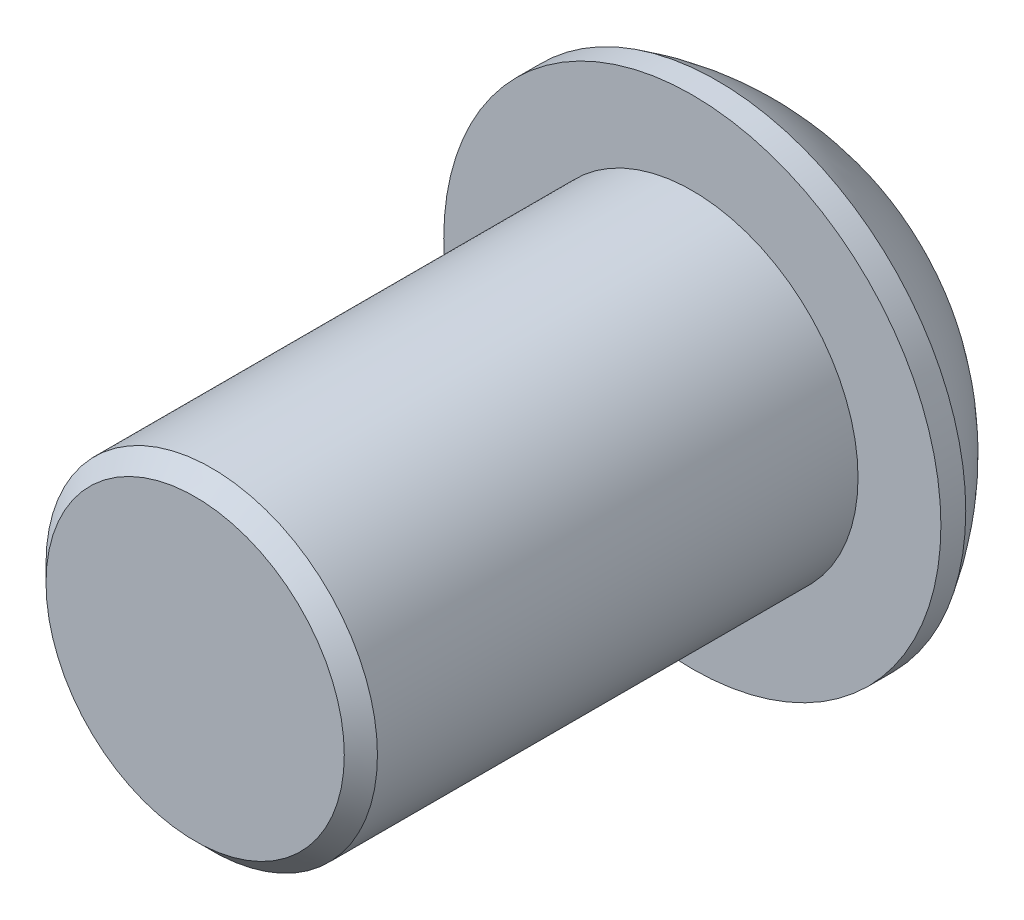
ISO-10303-21;
HEADER;
FILE_DESCRIPTION(('STEP AP214'),'2;1');
FILE_NAME('part.step','',(''),(''),'','','');
FILE_SCHEMA(('AUTOMOTIVE_DESIGN { 1 0 10303 214 1 1 1 1 }'));
ENDSEC;
DATA;
#1=APPLICATION_CONTEXT('core data for automotive mechanical design processes');
#2=APPLICATION_PROTOCOL_DEFINITION('international standard','automotive_design',2000,#1);
#3=PRODUCT_CONTEXT('',#1,'mechanical');
#4=PRODUCT('Part','Part','',(#3));
#5=PRODUCT_RELATED_PRODUCT_CATEGORY('part','',(#4));
#6=PRODUCT_DEFINITION_FORMATION('','',#4);
#7=PRODUCT_DEFINITION_CONTEXT('part definition',#1,'design');
#8=PRODUCT_DEFINITION('design','',#6,#7);
#9=PRODUCT_DEFINITION_SHAPE('','',#8);
#10=(LENGTH_UNIT() NAMED_UNIT(*) SI_UNIT(.MILLI.,.METRE.));
#11=(NAMED_UNIT(*) PLANE_ANGLE_UNIT() SI_UNIT($,.RADIAN.));
#12=(NAMED_UNIT(*) SI_UNIT($,.STERADIAN.) SOLID_ANGLE_UNIT());
#13=UNCERTAINTY_MEASURE_WITH_UNIT(LENGTH_MEASURE(1.E-05),#10,'distance_accuracy_value','');
#14=(GEOMETRIC_REPRESENTATION_CONTEXT(3) GLOBAL_UNCERTAINTY_ASSIGNED_CONTEXT((#13)) GLOBAL_UNIT_ASSIGNED_CONTEXT((#10,
#11,#12)) REPRESENTATION_CONTEXT('',''));
#15=CARTESIAN_POINT('',(0.,0.,0.));
#16=DIRECTION('',(0.,0.,1.));
#17=DIRECTION('',(1.,0.,0.));
#18=AXIS2_PLACEMENT_3D('',#15,#16,#17);
#19=CARTESIAN_POINT('',(0.,0.,1.49999960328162));
#20=DIRECTION('',(0.,0.,1.));
#21=DIRECTION('',(1.,0.,0.));
#22=AXIS2_PLACEMENT_3D('',#19,#20,#21);
#23=DEGENERATE_TOROIDAL_SURFACE('',#22,0.00166644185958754,3.5,.F.);
#24=CARTESIAN_POINT('',(0.,0.,-0.3));
#25=DIRECTION('',(0.,0.,1.));
#26=DIRECTION('',(1.,0.,0.));
#27=AXIS2_PLACEMENT_3D('',#24,#25,#26);
#28=CIRCLE('',#27,3.);
#29=CARTESIAN_POINT('',(3.,0.,-0.3));
#30=VERTEX_POINT('',#29);
#31=EDGE_CURVE('E124',#30,#30,#28,.T.);
#32=ORIENTED_EDGE('',*,*,#31,.F.);
#33=EDGE_LOOP('',(#32));
#34=FACE_BOUND('',#33,.T.);
#35=CARTESIAN_POINT('',(0.,0.,-1.));
#36=DIRECTION('',(0.,0.,-1.));
#37=DIRECTION('',(-1.,0.,0.));
#38=AXIS2_PLACEMENT_3D('',#35,#36,#37);
#39=CIRCLE('',#38,2.44782370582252);
#40=CARTESIAN_POINT('',(-0.25,2.43502379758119,-1.));
#41=VERTEX_POINT('',#40);
#42=CARTESIAN_POINT('',(0.25,2.43502379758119,-1.));
#43=VERTEX_POINT('',#42);
#44=EDGE_CURVE('E13',#41,#43,#39,.T.);
#45=ORIENTED_EDGE('',*,*,#44,.F.);
#46=CARTESIAN_POINT('',(-0.25,0.,-1.99094067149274));
#47=CARTESIAN_POINT('',(-0.25,-0.0835197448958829,-1.99094334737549));
#48=CARTESIAN_POINT('',(-0.25,-0.167012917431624,-1.98792538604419));
#49=CARTESIAN_POINT('',(-0.25,-0.418925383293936,-1.96971961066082));
#50=CARTESIAN_POINT('',(-0.25,-0.586780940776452,-1.94523588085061));
#51=CARTESIAN_POINT('',(-0.25,-0.917369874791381,-1.87216571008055));
#52=CARTESIAN_POINT('',(-0.25,-1.08009439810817,-1.82353980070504));
#53=CARTESIAN_POINT('',(-0.25,-1.39666712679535,-1.70323651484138));
#54=CARTESIAN_POINT('',(-0.25,-1.55052222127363,-1.63157732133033));
#55=CARTESIAN_POINT('',(-0.25,-1.84618692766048,-1.46674046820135));
#56=CARTESIAN_POINT('',(-0.25,-1.9879976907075,-1.37356486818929));
#57=CARTESIAN_POINT('',(-0.25,-2.27804977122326,-1.1511903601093));
#58=CARTESIAN_POINT('',(-0.25,-2.42372322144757,-1.01861845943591));
#59=CARTESIAN_POINT('',(-0.25,-2.69078977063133,-0.730855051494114));
#60=CARTESIAN_POINT('',(-0.25,-2.81217153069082,-0.575653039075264));
#61=CARTESIAN_POINT('',(-0.25,-3.02713811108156,-0.247093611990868));
#62=CARTESIAN_POINT('',(-0.25,-3.12072763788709,-0.0737392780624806));
#63=CARTESIAN_POINT('',(-0.25,-3.27746444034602,0.28620406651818));
#64=CARTESIAN_POINT('',(-0.25,-3.34061447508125,0.472791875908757));
#65=CARTESIAN_POINT('',(-0.25,-3.43469691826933,0.853929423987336));
#66=CARTESIAN_POINT('',(-0.25,-3.46562794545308,1.04847950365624));
#67=CARTESIAN_POINT('',(-0.25,-3.49438906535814,1.44001341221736));
#68=CARTESIAN_POINT('',(-0.25,-3.49221876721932,1.63699726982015));
#69=CARTESIAN_POINT('',(-0.25,-3.45483820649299,2.02780344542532));
#70=CARTESIAN_POINT('',(-0.25,-3.41962815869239,2.22162578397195));
#71=CARTESIAN_POINT('',(-0.25,-3.31716766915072,2.6006087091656));
#72=CARTESIAN_POINT('',(-0.25,-3.24991713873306,2.78576927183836));
#73=CARTESIAN_POINT('',(-0.25,-3.0852846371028,3.14217239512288));
#74=CARTESIAN_POINT('',(-0.25,-2.98790257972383,3.3134149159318));
#75=CARTESIAN_POINT('',(-0.25,-2.76577180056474,3.63711878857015));
#76=CARTESIAN_POINT('',(-0.25,-2.64102332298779,3.78958030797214));
#77=CARTESIAN_POINT('',(-0.25,-2.36770387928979,4.07139490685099));
#78=CARTESIAN_POINT('',(-0.25,-2.21913308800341,4.20074815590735));
#79=CARTESIAN_POINT('',(-0.25,-1.9023731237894,4.43267816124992));
#80=CARTESIAN_POINT('',(-0.25,-1.73418354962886,4.53525436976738));
#81=CARTESIAN_POINT('',(-0.25,-1.38299790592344,4.71071350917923));
#82=CARTESIAN_POINT('',(-0.25,-1.20000186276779,4.78359649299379));
#83=CARTESIAN_POINT('',(-0.25,-0.824273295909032,4.8976002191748));
#84=CARTESIAN_POINT('',(-0.25,-0.63154105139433,4.93872187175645));
#85=CARTESIAN_POINT('',(-0.25,-0.339517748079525,4.97570262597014));
#86=CARTESIAN_POINT('',(-0.25,-0.241646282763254,4.98391079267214));
#87=CARTESIAN_POINT('',(-0.25,-0.045560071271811,4.99202260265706));
#88=CARTESIAN_POINT('',(-0.25,0.0526546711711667,4.99192633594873));
#89=CARTESIAN_POINT('',(-0.25,0.346725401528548,4.97914684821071));
#90=CARTESIAN_POINT('',(-0.25,0.542181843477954,4.95399480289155));
#91=CARTESIAN_POINT('',(-0.25,0.925487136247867,4.87136897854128));
#92=CARTESIAN_POINT('',(-0.25,1.11335471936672,4.81398075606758));
#93=CARTESIAN_POINT('',(-0.25,1.47685550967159,4.6685500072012));
#94=CARTESIAN_POINT('',(-0.25,1.6524886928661,4.58050742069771));
#95=CARTESIAN_POINT('',(-0.25,1.98696719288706,4.3759892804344));
#96=CARTESIAN_POINT('',(-0.25,2.14576714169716,4.25943955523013));
#97=CARTESIAN_POINT('',(-0.25,2.44154937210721,4.00133497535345));
#98=CARTESIAN_POINT('',(-0.25,2.5785316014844,3.85978006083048));
#99=CARTESIAN_POINT('',(-0.25,2.82679526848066,3.55567448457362));
#100=CARTESIAN_POINT('',(-0.25,2.93807522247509,3.3931226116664));
#101=CARTESIAN_POINT('',(-0.25,3.13176594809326,3.05164362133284));
#102=CARTESIAN_POINT('',(-0.25,3.21417668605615,2.87271648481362));
#103=CARTESIAN_POINT('',(-0.25,3.34778967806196,2.5035653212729));
#104=CARTESIAN_POINT('',(-0.25,3.39899176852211,2.31334123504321));
#105=CARTESIAN_POINT('',(-0.25,3.46873334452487,1.92699697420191));
#106=CARTESIAN_POINT('',(-0.25,3.48727283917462,1.73087680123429));
#107=CARTESIAN_POINT('',(-0.25,3.49116297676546,1.33830750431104));
#108=CARTESIAN_POINT('',(-0.25,3.47651360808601,1.14185838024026));
#109=CARTESIAN_POINT('',(-0.25,3.41444174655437,0.754207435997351));
#110=CARTESIAN_POINT('',(-0.25,3.36701918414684,0.563005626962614));
#111=CARTESIAN_POINT('',(-0.25,3.24074655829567,0.191275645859));
#112=CARTESIAN_POINT('',(-0.25,3.16189619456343,0.0107475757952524));
#113=CARTESIAN_POINT('',(-0.25,2.97500783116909,-0.334504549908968));
#114=CARTESIAN_POINT('',(-0.25,2.86697044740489,-0.499228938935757));
#115=CARTESIAN_POINT('',(-0.25,2.62478217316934,-0.808193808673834));
#116=CARTESIAN_POINT('',(-0.25,2.4906326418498,-0.952435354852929));
#117=CARTESIAN_POINT('',(-0.25,2.19999958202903,-1.21636746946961));
#118=CARTESIAN_POINT('',(-0.25,2.04351330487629,-1.33605501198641));
#119=CARTESIAN_POINT('',(-0.25,1.71264939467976,-1.54747976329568));
#120=CARTESIAN_POINT('',(-0.25,1.53826780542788,-1.63921077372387));
#121=CARTESIAN_POINT('',(-0.25,1.176607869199,-1.79204479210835));
#122=CARTESIAN_POINT('',(-0.25,0.98933698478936,-1.85316535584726));
#123=CARTESIAN_POINT('',(-0.25,0.66757346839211,-1.92893436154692));
#124=CARTESIAN_POINT('',(-0.25,0.535025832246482,-1.95215538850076));
#125=CARTESIAN_POINT('',(-0.25,0.268293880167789,-1.98314346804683));
#126=CARTESIAN_POINT('',(-0.25,0.134112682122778,-1.99093637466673));
#127=CARTESIAN_POINT('',(-0.25,0.,-1.99094067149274));
#128=B_SPLINE_CURVE_WITH_KNOTS('',3,(#46,#47,#48,#49,#50,#51,#52,#53,#54,#55,#56,#57,#58,#59,
#60,#61,#62,#63,#64,#65,#66,#67,#68,#69,#70,#71,#72,#73,#74,#75,#76,#77,#78,#79,#80,#81,#82,#83,
#84,#85,#86,#87,#88,#89,#90,#91,#92,#93,#94,#95,#96,#97,#98,#99,#100,#101,#102,#103,#104,#105,
#106,#107,#108,#109,#110,#111,#112,#113,#114,#115,#116,#117,#118,#119,#120,#121,#122,#123,#124,
#125,#126,#127),.UNSPECIFIED.,.T.,.F.,(4,2,2,2,2,2,2,2,2,2,2,2,2,2,2,2,2,2,2,2,2,2,2,2,2,2,2,2,
2,2,2,2,2,2,2,2,2,2,2,2,4),(0.,0.250487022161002,0.757412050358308,1.26516855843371,
1.77252521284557,2.27983332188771,2.86787171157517,3.4561839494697,4.04439650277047,
4.63255572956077,5.2207401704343,5.80893155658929,6.39711911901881,6.98530830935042,
7.57349918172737,8.16168480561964,8.74986611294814,9.33805945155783,9.92625174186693,
10.5144271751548,10.8087690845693,11.1031078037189,11.6912660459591,12.2778706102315,
12.8644763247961,13.4526248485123,14.0407747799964,14.628958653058,15.2171432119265,
15.8053308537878,16.393518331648,16.9817060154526,17.5698949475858,18.1580894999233,
18.7462716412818,19.3344231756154,19.9226471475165,20.5110014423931,21.099017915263,
21.5019157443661,21.9041378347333),.UNSPECIFIED.);
#129=CARTESIAN_POINT('',(-0.25,-2.43502379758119,-1.));
#130=VERTEX_POINT('',#129);
#131=EDGE_CURVE('E51',#41,#130,#128,.T.);
#132=ORIENTED_EDGE('',*,*,#131,.T.);
#133=CARTESIAN_POINT('',(0.25,-2.43502379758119,-1.));
#134=VERTEX_POINT('',#133);
#135=EDGE_CURVE('E61',#134,#130,#39,.T.);
#136=ORIENTED_EDGE('',*,*,#135,.F.);
#137=CARTESIAN_POINT('',(0.25,0.,-1.99094067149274));
#138=CARTESIAN_POINT('',(0.25,0.0835197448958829,-1.99094334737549));
#139=CARTESIAN_POINT('',(0.25,0.167012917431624,-1.98792538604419));
#140=CARTESIAN_POINT('',(0.25,0.418925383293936,-1.96971961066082));
#141=CARTESIAN_POINT('',(0.25,0.586780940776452,-1.94523588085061));
#142=CARTESIAN_POINT('',(0.25,0.917369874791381,-1.87216571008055));
#143=CARTESIAN_POINT('',(0.25,1.08009439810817,-1.82353980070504));
#144=CARTESIAN_POINT('',(0.25,1.39666712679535,-1.70323651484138));
#145=CARTESIAN_POINT('',(0.25,1.55052222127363,-1.63157732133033));
#146=CARTESIAN_POINT('',(0.25,1.84618692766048,-1.46674046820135));
#147=CARTESIAN_POINT('',(0.25,1.9879976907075,-1.37356486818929));
#148=CARTESIAN_POINT('',(0.25,2.27804977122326,-1.1511903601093));
#149=CARTESIAN_POINT('',(0.25,2.42372322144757,-1.01861845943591));
#150=CARTESIAN_POINT('',(0.25,2.69078977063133,-0.730855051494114));
#151=CARTESIAN_POINT('',(0.25,2.81217153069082,-0.575653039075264));
#152=CARTESIAN_POINT('',(0.25,3.02713811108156,-0.247093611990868));
#153=CARTESIAN_POINT('',(0.25,3.12072763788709,-0.0737392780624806));
#154=CARTESIAN_POINT('',(0.25,3.27746444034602,0.28620406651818));
#155=CARTESIAN_POINT('',(0.25,3.34061447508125,0.472791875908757));
#156=CARTESIAN_POINT('',(0.25,3.43469691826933,0.853929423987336));
#157=CARTESIAN_POINT('',(0.25,3.46562794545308,1.04847950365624));
#158=CARTESIAN_POINT('',(0.25,3.49438906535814,1.44001341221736));
#159=CARTESIAN_POINT('',(0.25,3.49221876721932,1.63699726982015));
#160=CARTESIAN_POINT('',(0.25,3.45483820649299,2.02780344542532));
#161=CARTESIAN_POINT('',(0.25,3.41962815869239,2.22162578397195));
#162=CARTESIAN_POINT('',(0.25,3.31716766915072,2.6006087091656));
#163=CARTESIAN_POINT('',(0.25,3.24991713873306,2.78576927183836));
#164=CARTESIAN_POINT('',(0.25,3.0852846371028,3.14217239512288));
#165=CARTESIAN_POINT('',(0.25,2.98790257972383,3.3134149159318));
#166=CARTESIAN_POINT('',(0.25,2.76577180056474,3.63711878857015));
#167=CARTESIAN_POINT('',(0.25,2.64102332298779,3.78958030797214));
#168=CARTESIAN_POINT('',(0.25,2.36770387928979,4.07139490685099));
#169=CARTESIAN_POINT('',(0.25,2.21913308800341,4.20074815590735));
#170=CARTESIAN_POINT('',(0.25,1.9023731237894,4.43267816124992));
#171=CARTESIAN_POINT('',(0.25,1.73418354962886,4.53525436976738));
#172=CARTESIAN_POINT('',(0.25,1.38299790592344,4.71071350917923));
#173=CARTESIAN_POINT('',(0.25,1.20000186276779,4.78359649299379));
#174=CARTESIAN_POINT('',(0.25,0.824273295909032,4.89760021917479));
#175=CARTESIAN_POINT('',(0.25,0.63154105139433,4.93872187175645));
#176=CARTESIAN_POINT('',(0.25,0.339517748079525,4.97570262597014));
#177=CARTESIAN_POINT('',(0.25,0.241646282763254,4.98391079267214));
#178=CARTESIAN_POINT('',(0.25,0.045560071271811,4.99202260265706));
#179=CARTESIAN_POINT('',(0.25,-0.0526546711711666,4.99192633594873));
#180=CARTESIAN_POINT('',(0.25,-0.346725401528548,4.97914684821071));
#181=CARTESIAN_POINT('',(0.25,-0.542181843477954,4.95399480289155));
#182=CARTESIAN_POINT('',(0.25,-0.925487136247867,4.87136897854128));
#183=CARTESIAN_POINT('',(0.25,-1.11335471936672,4.81398075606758));
#184=CARTESIAN_POINT('',(0.25,-1.47685550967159,4.6685500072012));
#185=CARTESIAN_POINT('',(0.25,-1.6524886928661,4.58050742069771));
#186=CARTESIAN_POINT('',(0.25,-1.98696719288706,4.3759892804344));
#187=CARTESIAN_POINT('',(0.25,-2.14576714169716,4.25943955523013));
#188=CARTESIAN_POINT('',(0.25,-2.44154937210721,4.00133497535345));
#189=CARTESIAN_POINT('',(0.25,-2.5785316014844,3.85978006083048));
#190=CARTESIAN_POINT('',(0.25,-2.82679526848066,3.55567448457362));
#191=CARTESIAN_POINT('',(0.25,-2.93807522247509,3.3931226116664));
#192=CARTESIAN_POINT('',(0.25,-3.13176594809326,3.05164362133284));
#193=CARTESIAN_POINT('',(0.25,-3.21417668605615,2.87271648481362));
#194=CARTESIAN_POINT('',(0.25,-3.34778967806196,2.5035653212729));
#195=CARTESIAN_POINT('',(0.25,-3.39899176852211,2.31334123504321));
#196=CARTESIAN_POINT('',(0.25,-3.46873334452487,1.92699697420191));
#197=CARTESIAN_POINT('',(0.25,-3.48727283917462,1.73087680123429));
#198=CARTESIAN_POINT('',(0.25,-3.49116297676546,1.33830750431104));
#199=CARTESIAN_POINT('',(0.25,-3.47651360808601,1.14185838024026));
#200=CARTESIAN_POINT('',(0.25,-3.41444174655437,0.754207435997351));
#201=CARTESIAN_POINT('',(0.25,-3.36701918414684,0.563005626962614));
#202=CARTESIAN_POINT('',(0.25,-3.24074655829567,0.191275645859));
#203=CARTESIAN_POINT('',(0.25,-3.16189619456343,0.0107475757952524));
#204=CARTESIAN_POINT('',(0.25,-2.97500783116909,-0.334504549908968));
#205=CARTESIAN_POINT('',(0.25,-2.86697044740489,-0.499228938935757));
#206=CARTESIAN_POINT('',(0.25,-2.62478217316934,-0.808193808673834));
#207=CARTESIAN_POINT('',(0.25,-2.4906326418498,-0.952435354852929));
#208=CARTESIAN_POINT('',(0.25,-2.19999958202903,-1.21636746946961));
#209=CARTESIAN_POINT('',(0.25,-2.04351330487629,-1.33605501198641));
#210=CARTESIAN_POINT('',(0.25,-1.71264939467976,-1.54747976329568));
#211=CARTESIAN_POINT('',(0.25,-1.53826780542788,-1.63921077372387));
#212=CARTESIAN_POINT('',(0.25,-1.176607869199,-1.79204479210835));
#213=CARTESIAN_POINT('',(0.25,-0.98933698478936,-1.85316535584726));
#214=CARTESIAN_POINT('',(0.25,-0.66757346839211,-1.92893436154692));
#215=CARTESIAN_POINT('',(0.25,-0.535025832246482,-1.95215538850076));
#216=CARTESIAN_POINT('',(0.25,-0.268293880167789,-1.98314346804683));
#217=CARTESIAN_POINT('',(0.25,-0.134112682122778,-1.99093637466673));
#218=CARTESIAN_POINT('',(0.25,0.,-1.99094067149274));
#219=B_SPLINE_CURVE_WITH_KNOTS('',3,(#137,#138,#139,#140,#141,#142,#143,#144,#145,#146,#147,
#148,#149,#150,#151,#152,#153,#154,#155,#156,#157,#158,#159,#160,#161,#162,#163,#164,#165,#166,
#167,#168,#169,#170,#171,#172,#173,#174,#175,#176,#177,#178,#179,#180,#181,#182,#183,#184,#185,
#186,#187,#188,#189,#190,#191,#192,#193,#194,#195,#196,#197,#198,#199,#200,#201,#202,#203,#204,
#205,#206,#207,#208,#209,#210,#211,#212,#213,#214,#215,#216,#217,#218),.UNSPECIFIED.,.T.,.F.,(4,
2,2,2,2,2,2,2,2,2,2,2,2,2,2,2,2,2,2,2,2,2,2,2,2,2,2,2,2,2,2,2,2,2,2,2,2,2,2,2,4),(0.,
0.250487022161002,0.757412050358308,1.26516855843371,1.77252521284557,2.27983332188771,
2.86787171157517,3.4561839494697,4.04439650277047,4.63255572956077,5.2207401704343,
5.80893155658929,6.39711911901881,6.98530830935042,7.57349918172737,8.16168480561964,
8.74986611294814,9.33805945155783,9.92625174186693,10.5144271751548,10.8087690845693,
11.1031078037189,11.6912660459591,12.2778706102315,12.8644763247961,13.4526248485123,
14.0407747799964,14.628958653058,15.2171432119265,15.8053308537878,16.393518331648,
16.9817060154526,17.5698949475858,18.1580894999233,18.7462716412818,19.3344231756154,
19.9226471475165,20.5110014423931,21.099017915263,21.5019157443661,21.9041378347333),.UNSPECIFIED.);
#220=EDGE_CURVE('E83',#134,#43,#219,.T.);
#221=ORIENTED_EDGE('',*,*,#220,.T.);
#222=EDGE_LOOP('',(#45,#132,#136,#221));
#223=FACE_BOUND('',#222,.T.);
#224=ADVANCED_FACE('F47',(#34,#223),#23,.F.);
#225=CARTESIAN_POINT('',(0.,0.,6.));
#226=DIRECTION('',(0.,0.,-1.));
#227=DIRECTION('',(-1.,0.,0.));
#228=AXIS2_PLACEMENT_3D('',#225,#226,#227);
#229=CYLINDRICAL_SURFACE('',#228,2.);
#230=CARTESIAN_POINT('',(0.,0.,5.8));
#231=DIRECTION('',(0.,0.,1.));
#232=DIRECTION('',(1.,0.,0.));
#233=AXIS2_PLACEMENT_3D('',#230,#231,#232);
#234=CIRCLE('',#233,2.);
#235=CARTESIAN_POINT('',(2.,0.,5.8));
#236=VERTEX_POINT('',#235);
#237=EDGE_CURVE('E88',#236,#236,#234,.F.);
#238=ORIENTED_EDGE('',*,*,#237,.T.);
#239=EDGE_LOOP('',(#238));
#240=FACE_BOUND('',#239,.T.);
#241=CARTESIAN_POINT('',(0.,0.,0.));
#242=DIRECTION('',(0.,0.,-1.));
#243=DIRECTION('',(-1.,0.,0.));
#244=AXIS2_PLACEMENT_3D('',#241,#242,#243);
#245=CIRCLE('',#244,2.);
#246=CARTESIAN_POINT('',(-2.,0.,0.));
#247=VERTEX_POINT('',#246);
#248=EDGE_CURVE('E126',#247,#247,#245,.T.);
#249=ORIENTED_EDGE('',*,*,#248,.F.);
#250=EDGE_LOOP('',(#249));
#251=FACE_BOUND('',#250,.T.);
#252=ADVANCED_FACE('F116',(#240,#251),#229,.T.);
#253=CARTESIAN_POINT('',(0.,0.,6.));
#254=DIRECTION('',(0.,0.,1.));
#255=DIRECTION('',(1.,0.,0.));
#256=AXIS2_PLACEMENT_3D('',#253,#254,#255);
#257=PLANE('',#256);
#258=CARTESIAN_POINT('',(0.,0.,6.));
#259=DIRECTION('',(0.,0.,1.));
#260=DIRECTION('',(1.,0.,0.));
#261=AXIS2_PLACEMENT_3D('',#258,#259,#260);
#262=CIRCLE('',#261,1.8);
#263=CARTESIAN_POINT('',(1.8,0.,6.));
#264=VERTEX_POINT('',#263);
#265=EDGE_CURVE('E130',#264,#264,#262,.T.);
#266=ORIENTED_EDGE('',*,*,#265,.T.);
#267=EDGE_LOOP('',(#266));
#268=FACE_BOUND('',#267,.T.);
#269=ADVANCED_FACE('F111',(#268),#257,.T.);
#270=CARTESIAN_POINT('',(0.,0.,6.));
#271=DIRECTION('',(0.,0.,-1.));
#272=DIRECTION('',(-1.,0.,0.));
#273=AXIS2_PLACEMENT_3D('',#270,#271,#272);
#274=CONICAL_SURFACE('',#273,1.8,0.785398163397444);
#275=ORIENTED_EDGE('',*,*,#237,.F.);
#276=EDGE_LOOP('',(#275));
#277=FACE_BOUND('',#276,.T.);
#278=ORIENTED_EDGE('',*,*,#265,.F.);
#279=EDGE_LOOP('',(#278));
#280=FACE_BOUND('',#279,.T.);
#281=ADVANCED_FACE('F49',(#277,#280),#274,.T.);
#282=CARTESIAN_POINT('',(0.,0.,0.));
#283=DIRECTION('',(0.,0.,-1.));
#284=DIRECTION('',(-1.,0.,0.));
#285=AXIS2_PLACEMENT_3D('',#282,#283,#284);
#286=PLANE('',#285);
#287=CARTESIAN_POINT('',(0.,0.,0.));
#288=DIRECTION('',(0.,0.,1.));
#289=DIRECTION('',(1.,0.,0.));
#290=AXIS2_PLACEMENT_3D('',#287,#288,#289);
#291=CIRCLE('',#290,3.);
#292=CARTESIAN_POINT('',(3.,0.,0.));
#293=VERTEX_POINT('',#292);
#294=EDGE_CURVE('E127',#293,#293,#291,.T.);
#295=ORIENTED_EDGE('',*,*,#294,.T.);
#296=EDGE_LOOP('',(#295));
#297=FACE_BOUND('',#296,.T.);
#298=ORIENTED_EDGE('',*,*,#248,.T.);
#299=EDGE_LOOP('',(#298));
#300=FACE_BOUND('',#299,.T.);
#301=ADVANCED_FACE('F103',(#297,#300),#286,.F.);
#302=CARTESIAN_POINT('',(0.,0.,0.));
#303=DIRECTION('',(0.,0.,1.));
#304=DIRECTION('',(1.,0.,0.));
#305=AXIS2_PLACEMENT_3D('',#302,#303,#304);
#306=CYLINDRICAL_SURFACE('',#305,3.);
#307=ORIENTED_EDGE('',*,*,#294,.F.);
#308=EDGE_LOOP('',(#307));
#309=FACE_BOUND('',#308,.T.);
#310=ORIENTED_EDGE('',*,*,#31,.T.);
#311=EDGE_LOOP('',(#310));
#312=FACE_BOUND('',#311,.T.);
#313=ADVANCED_FACE('F102',(#309,#312),#306,.T.);
#314=CARTESIAN_POINT('',(-0.25,3.14057290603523,-2.));
#315=DIRECTION('',(-1.,0.,0.));
#316=DIRECTION('',(0.,-1.,0.));
#317=AXIS2_PLACEMENT_3D('',#314,#315,#316);
#318=PLANE('',#317);
#319=DIRECTION('',(0.,-1.,0.));
#320=VECTOR('',#319,1.);
#321=CARTESIAN_POINT('',(-0.25,3.14057290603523,-1.));
#322=LINE('',#321,#320);
#323=EDGE_CURVE('E80',#41,#130,#322,.T.);
#324=ORIENTED_EDGE('',*,*,#323,.T.);
#325=ORIENTED_EDGE('',*,*,#131,.F.);
#326=EDGE_LOOP('',(#324,#325));
#327=FACE_BOUND('',#326,.T.);
#328=ADVANCED_FACE('F79',(#327),#318,.F.);
#329=CARTESIAN_POINT('',(0.25,3.14057290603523,-2.));
#330=DIRECTION('',(1.,0.,0.));
#331=DIRECTION('',(0.,1.,0.));
#332=AXIS2_PLACEMENT_3D('',#329,#330,#331);
#333=PLANE('',#332);
#334=DIRECTION('',(0.,1.,0.));
#335=VECTOR('',#334,1.);
#336=CARTESIAN_POINT('',(0.25,3.14057290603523,-1.));
#337=LINE('',#336,#335);
#338=EDGE_CURVE('E67',#134,#43,#337,.T.);
#339=ORIENTED_EDGE('',*,*,#338,.T.);
#340=ORIENTED_EDGE('',*,*,#220,.F.);
#341=EDGE_LOOP('',(#339,#340));
#342=FACE_BOUND('',#341,.T.);
#343=ADVANCED_FACE('F96',(#342),#333,.F.);
#344=CARTESIAN_POINT('',(-0.25,-3.14057290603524,-1.));
#345=DIRECTION('',(0.,0.,-1.));
#346=DIRECTION('',(-1.,0.,0.));
#347=AXIS2_PLACEMENT_3D('',#344,#345,#346);
#348=PLANE('',#347);
#349=ORIENTED_EDGE('',*,*,#44,.T.);
#350=ORIENTED_EDGE('',*,*,#338,.F.);
#351=ORIENTED_EDGE('',*,*,#135,.T.);
#352=ORIENTED_EDGE('',*,*,#323,.F.);
#353=EDGE_LOOP('',(#349,#350,#351,#352));
#354=FACE_BOUND('',#353,.T.);
#355=ADVANCED_FACE('F84',(#354),#348,.T.);
#356=CLOSED_SHELL('',(#224,#252,#269,#281,#301,#313,#328,#343,#355));
#357=MANIFOLD_SOLID_BREP('B2',#356);
#358=ADVANCED_BREP_SHAPE_REPRESENTATION('',(#18,#357),#14);
#359=SHAPE_DEFINITION_REPRESENTATION(#9,#358);
ENDSEC;
END-ISO-10303-21;
